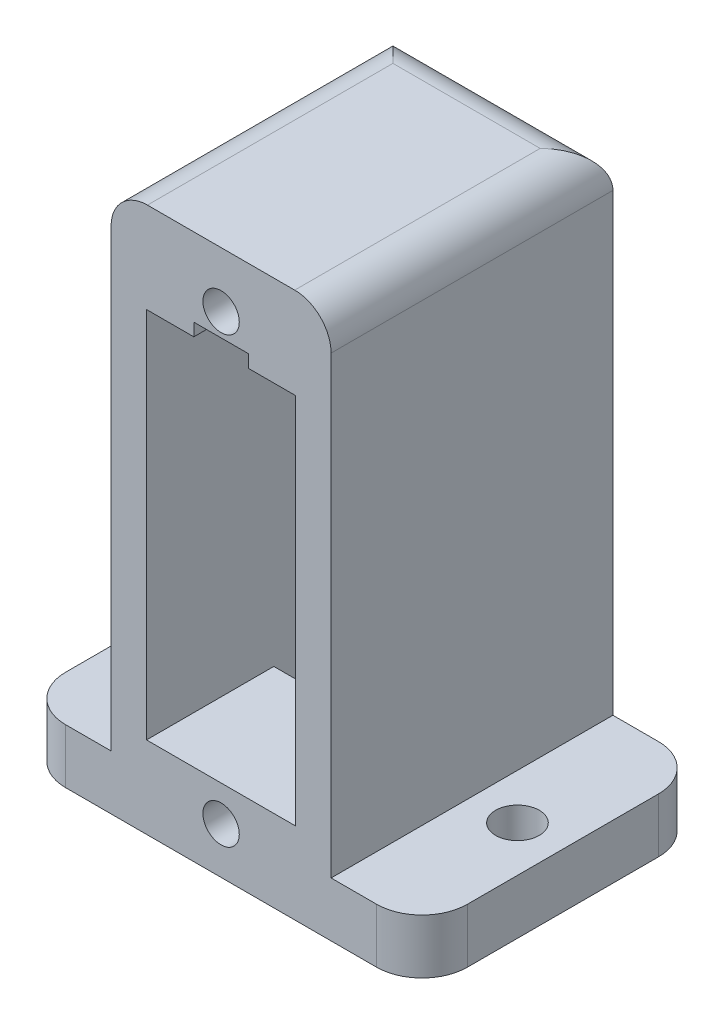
ISO-10303-21;
HEADER;
FILE_DESCRIPTION(('STEP AP214'),'2;1');
FILE_NAME('part.step','',(''),(''),'','','');
FILE_SCHEMA(('AUTOMOTIVE_DESIGN { 1 0 10303 214 1 1 1 1 }'));
ENDSEC;
DATA;
#1=APPLICATION_CONTEXT('core data for automotive mechanical design processes');
#2=APPLICATION_PROTOCOL_DEFINITION('international standard','automotive_design',2000,#1);
#3=PRODUCT_CONTEXT('',#1,'mechanical');
#4=PRODUCT('Part','Part','',(#3));
#5=PRODUCT_RELATED_PRODUCT_CATEGORY('part','',(#4));
#6=PRODUCT_DEFINITION_FORMATION('','',#4);
#7=PRODUCT_DEFINITION_CONTEXT('part definition',#1,'design');
#8=PRODUCT_DEFINITION('design','',#6,#7);
#9=PRODUCT_DEFINITION_SHAPE('','',#8);
#10=(LENGTH_UNIT() NAMED_UNIT(*) SI_UNIT(.MILLI.,.METRE.));
#11=(NAMED_UNIT(*) PLANE_ANGLE_UNIT() SI_UNIT($,.RADIAN.));
#12=(NAMED_UNIT(*) SI_UNIT($,.STERADIAN.) SOLID_ANGLE_UNIT());
#13=UNCERTAINTY_MEASURE_WITH_UNIT(LENGTH_MEASURE(1.E-05),#10,'distance_accuracy_value','');
#14=(GEOMETRIC_REPRESENTATION_CONTEXT(3) GLOBAL_UNCERTAINTY_ASSIGNED_CONTEXT((#13)) GLOBAL_UNIT_ASSIGNED_CONTEXT((#10,
#11,#12)) REPRESENTATION_CONTEXT('',''));
#15=CARTESIAN_POINT('',(0.,0.,0.));
#16=DIRECTION('',(0.,0.,1.));
#17=DIRECTION('',(1.,0.,0.));
#18=AXIS2_PLACEMENT_3D('',#15,#16,#17);
#19=CARTESIAN_POINT('',(12.1,0.,15.5));
#20=DIRECTION('',(-1.,0.,0.));
#21=DIRECTION('',(0.,0.,1.));
#22=AXIS2_PLACEMENT_3D('',#19,#20,#21);
#23=PLANE('',#22);
#24=DIRECTION('',(0.,0.,1.));
#25=VECTOR('',#24,1.);
#26=CARTESIAN_POINT('',(12.1,3.,15.5));
#27=LINE('',#26,#25);
#28=CARTESIAN_POINT('',(12.1,3.,0.));
#29=VERTEX_POINT('',#28);
#30=CARTESIAN_POINT('',(12.1,3.,15.5));
#31=VERTEX_POINT('',#30);
#32=EDGE_CURVE('E55',#29,#31,#27,.T.);
#33=ORIENTED_EDGE('',*,*,#32,.F.);
#34=DIRECTION('',(0.,1.,0.));
#35=VECTOR('',#34,1.);
#36=CARTESIAN_POINT('',(12.1,0.,0.));
#37=LINE('',#36,#35);
#38=CARTESIAN_POINT('',(12.1,28.,0.));
#39=VERTEX_POINT('',#38);
#40=EDGE_CURVE('E407',#29,#39,#37,.T.);
#41=ORIENTED_EDGE('',*,*,#40,.T.);
#42=DIRECTION('',(0.,0.,-1.));
#43=VECTOR('',#42,1.);
#44=CARTESIAN_POINT('',(12.1,28.,15.5));
#45=LINE('',#44,#43);
#46=CARTESIAN_POINT('',(12.1,28.,15.5));
#47=VERTEX_POINT('',#46);
#48=EDGE_CURVE('E11',#39,#47,#45,.F.);
#49=ORIENTED_EDGE('',*,*,#48,.T.);
#50=DIRECTION('',(0.,1.,0.));
#51=VECTOR('',#50,1.);
#52=CARTESIAN_POINT('',(12.1,0.,15.5));
#53=LINE('',#52,#51);
#54=EDGE_CURVE('E51',#31,#47,#53,.T.);
#55=ORIENTED_EDGE('',*,*,#54,.F.);
#56=EDGE_LOOP('',(#33,#41,#49,#55));
#57=FACE_BOUND('',#56,.T.);
#58=ADVANCED_FACE('F35',(#57),#23,.F.);
#59=CARTESIAN_POINT('',(0.,0.,15.5));
#60=DIRECTION('',(1.,0.,0.));
#61=DIRECTION('',(0.,0.,-1.));
#62=AXIS2_PLACEMENT_3D('',#59,#60,#61);
#63=PLANE('',#62);
#64=DIRECTION('',(0.,-1.,0.));
#65=VECTOR('',#64,1.);
#66=CARTESIAN_POINT('',(0.,0.,0.));
#67=LINE('',#66,#65);
#68=CARTESIAN_POINT('',(0.,28.,0.));
#69=VERTEX_POINT('',#68);
#70=CARTESIAN_POINT('',(0.,3.,0.));
#71=VERTEX_POINT('',#70);
#72=EDGE_CURVE('E389',#69,#71,#67,.T.);
#73=ORIENTED_EDGE('',*,*,#72,.T.);
#74=DIRECTION('',(0.,0.,1.));
#75=VECTOR('',#74,1.);
#76=CARTESIAN_POINT('',(0.,3.,15.5));
#77=LINE('',#76,#75);
#78=CARTESIAN_POINT('',(0.,3.,15.5));
#79=VERTEX_POINT('',#78);
#80=EDGE_CURVE('E251',#71,#79,#77,.T.);
#81=ORIENTED_EDGE('',*,*,#80,.T.);
#82=DIRECTION('',(0.,-1.,0.));
#83=VECTOR('',#82,1.);
#84=CARTESIAN_POINT('',(0.,0.,15.5));
#85=LINE('',#84,#83);
#86=CARTESIAN_POINT('',(0.,28.,15.5));
#87=VERTEX_POINT('',#86);
#88=EDGE_CURVE('E403',#87,#79,#85,.T.);
#89=ORIENTED_EDGE('',*,*,#88,.F.);
#90=DIRECTION('',(0.,0.,-1.));
#91=VECTOR('',#90,1.);
#92=CARTESIAN_POINT('',(0.,28.,15.5));
#93=LINE('',#92,#91);
#94=EDGE_CURVE('E431',#87,#69,#93,.T.);
#95=ORIENTED_EDGE('',*,*,#94,.T.);
#96=EDGE_LOOP('',(#73,#81,#89,#95));
#97=FACE_BOUND('',#96,.T.);
#98=ADVANCED_FACE('F452',(#97),#63,.F.);
#99=CARTESIAN_POINT('',(0.,0.,15.5));
#100=DIRECTION('',(0.,1.,0.));
#101=DIRECTION('',(0.,0.,1.));
#102=AXIS2_PLACEMENT_3D('',#99,#100,#101);
#103=PLANE('',#102);
#104=CARTESIAN_POINT('',(14.6,0.,13.));
#105=DIRECTION('',(0.,-1.,0.));
#106=DIRECTION('',(0.,0.,-1.));
#107=AXIS2_PLACEMENT_3D('',#104,#105,#106);
#108=CIRCLE('',#107,2.5);
#109=CARTESIAN_POINT('',(17.1,0.,13.));
#110=VERTEX_POINT('',#109);
#111=CARTESIAN_POINT('',(14.6,0.,15.5));
#112=VERTEX_POINT('',#111);
#113=EDGE_CURVE('E268',#110,#112,#108,.T.);
#114=ORIENTED_EDGE('',*,*,#113,.T.);
#115=DIRECTION('',(1.,0.,0.));
#116=VECTOR('',#115,1.);
#117=CARTESIAN_POINT('',(0.,0.,15.5));
#118=LINE('',#117,#116);
#119=CARTESIAN_POINT('',(-2.49999999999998,0.,15.5));
#120=VERTEX_POINT('',#119);
#121=EDGE_CURVE('E406',#120,#112,#118,.T.);
#122=ORIENTED_EDGE('',*,*,#121,.F.);
#123=CARTESIAN_POINT('',(-2.5,0.,13.));
#124=DIRECTION('',(0.,-1.,0.));
#125=DIRECTION('',(0.,0.,1.));
#126=AXIS2_PLACEMENT_3D('',#123,#124,#125);
#127=CIRCLE('',#126,2.5);
#128=CARTESIAN_POINT('',(-5.,0.,13.));
#129=VERTEX_POINT('',#128);
#130=EDGE_CURVE('E246',#120,#129,#127,.T.);
#131=ORIENTED_EDGE('',*,*,#130,.T.);
#132=DIRECTION('',(0.,0.,-1.));
#133=VECTOR('',#132,1.);
#134=CARTESIAN_POINT('',(-5.,0.,2.5));
#135=LINE('',#134,#133);
#136=CARTESIAN_POINT('',(-5.,0.,2.5));
#137=VERTEX_POINT('',#136);
#138=EDGE_CURVE('E212',#129,#137,#135,.T.);
#139=ORIENTED_EDGE('',*,*,#138,.T.);
#140=CARTESIAN_POINT('',(-2.5,0.,2.5));
#141=DIRECTION('',(0.,-1.,0.));
#142=DIRECTION('',(0.,0.,1.));
#143=AXIS2_PLACEMENT_3D('',#140,#141,#142);
#144=CIRCLE('',#143,2.5);
#145=CARTESIAN_POINT('',(-2.5,0.,0.));
#146=VERTEX_POINT('',#145);
#147=EDGE_CURVE('E233',#137,#146,#144,.T.);
#148=ORIENTED_EDGE('',*,*,#147,.T.);
#149=DIRECTION('',(1.,0.,0.));
#150=VECTOR('',#149,1.);
#151=CARTESIAN_POINT('',(0.,0.,0.));
#152=LINE('',#151,#150);
#153=CARTESIAN_POINT('',(1.95,0.,0.));
#154=VERTEX_POINT('',#153);
#155=EDGE_CURVE('E417',#146,#154,#152,.T.);
#156=ORIENTED_EDGE('',*,*,#155,.T.);
#157=DIRECTION('',(0.,0.,-1.));
#158=VECTOR('',#157,1.);
#159=CARTESIAN_POINT('',(1.95,0.,8.5));
#160=LINE('',#159,#158);
#161=CARTESIAN_POINT('',(1.95,0.,8.5));
#162=VERTEX_POINT('',#161);
#163=EDGE_CURVE('E312',#162,#154,#160,.T.);
#164=ORIENTED_EDGE('',*,*,#163,.F.);
#165=DIRECTION('',(-1.,0.,0.));
#166=VECTOR('',#165,1.);
#167=CARTESIAN_POINT('',(1.95,0.,8.5));
#168=LINE('',#167,#166);
#169=CARTESIAN_POINT('',(10.15,0.,8.5));
#170=VERTEX_POINT('',#169);
#171=EDGE_CURVE('E303',#170,#162,#168,.T.);
#172=ORIENTED_EDGE('',*,*,#171,.F.);
#173=DIRECTION('',(0.,0.,1.));
#174=VECTOR('',#173,1.);
#175=CARTESIAN_POINT('',(10.15,0.,8.5));
#176=LINE('',#175,#174);
#177=CARTESIAN_POINT('',(10.15,0.,0.));
#178=VERTEX_POINT('',#177);
#179=EDGE_CURVE('E315',#178,#170,#176,.T.);
#180=ORIENTED_EDGE('',*,*,#179,.F.);
#181=CARTESIAN_POINT('',(14.6,0.,0.));
#182=VERTEX_POINT('',#181);
#183=EDGE_CURVE('E416',#178,#182,#152,.T.);
#184=ORIENTED_EDGE('',*,*,#183,.T.);
#185=CARTESIAN_POINT('',(14.6,0.,2.5));
#186=DIRECTION('',(0.,-1.,0.));
#187=DIRECTION('',(0.,0.,-1.));
#188=AXIS2_PLACEMENT_3D('',#185,#186,#187);
#189=CIRCLE('',#188,2.5);
#190=CARTESIAN_POINT('',(17.1,0.,2.5));
#191=VERTEX_POINT('',#190);
#192=EDGE_CURVE('E262',#182,#191,#189,.T.);
#193=ORIENTED_EDGE('',*,*,#192,.T.);
#194=DIRECTION('',(0.,0.,1.));
#195=VECTOR('',#194,1.);
#196=CARTESIAN_POINT('',(17.1,0.,2.5));
#197=LINE('',#196,#195);
#198=EDGE_CURVE('E283',#191,#110,#197,.T.);
#199=ORIENTED_EDGE('',*,*,#198,.T.);
#200=EDGE_LOOP('',(#114,#122,#131,#139,#148,#156,#164,#172,#180,#184,#193,#199));
#201=FACE_BOUND('',#200,.T.);
#202=CARTESIAN_POINT('',(14.6,0.,7.75));
#203=DIRECTION('',(0.,-1.,0.));
#204=DIRECTION('',(0.,0.,-1.));
#205=AXIS2_PLACEMENT_3D('',#202,#203,#204);
#206=CIRCLE('',#205,1.20000000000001);
#207=CARTESIAN_POINT('',(14.6,0.,6.55));
#208=VERTEX_POINT('',#207);
#209=EDGE_CURVE('E258',#208,#208,#206,.T.);
#210=ORIENTED_EDGE('',*,*,#209,.F.);
#211=EDGE_LOOP('',(#210));
#212=FACE_BOUND('',#211,.T.);
#213=CARTESIAN_POINT('',(-2.5,0.,7.75));
#214=DIRECTION('',(0.,-1.,0.));
#215=DIRECTION('',(0.,0.,1.));
#216=AXIS2_PLACEMENT_3D('',#213,#214,#215);
#217=CIRCLE('',#216,1.20000000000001);
#218=CARTESIAN_POINT('',(-2.5,0.,8.95000000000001));
#219=VERTEX_POINT('',#218);
#220=EDGE_CURVE('E238',#219,#219,#217,.T.);
#221=ORIENTED_EDGE('',*,*,#220,.F.);
#222=EDGE_LOOP('',(#221));
#223=FACE_BOUND('',#222,.T.);
#224=ADVANCED_FACE('F477',(#201,#212,#223),#103,.F.);
#225=CARTESIAN_POINT('',(0.,30.,15.5));
#226=DIRECTION('',(0.,-1.,0.));
#227=DIRECTION('',(0.,0.,-1.));
#228=AXIS2_PLACEMENT_3D('',#225,#226,#227);
#229=PLANE('',#228);
#230=DIRECTION('',(-1.,0.,0.));
#231=VECTOR('',#230,1.);
#232=CARTESIAN_POINT('',(0.,30.,2.));
#233=LINE('',#232,#231);
#234=CARTESIAN_POINT('',(10.1,30.,2.));
#235=VERTEX_POINT('',#234);
#236=CARTESIAN_POINT('',(2.,30.,2.));
#237=VERTEX_POINT('',#236);
#238=EDGE_CURVE('E423',#235,#237,#233,.T.);
#239=ORIENTED_EDGE('',*,*,#238,.T.);
#240=DIRECTION('',(0.,0.,-1.));
#241=VECTOR('',#240,1.);
#242=CARTESIAN_POINT('',(2.,30.,15.5));
#243=LINE('',#242,#241);
#244=CARTESIAN_POINT('',(2.,30.,15.5));
#245=VERTEX_POINT('',#244);
#246=EDGE_CURVE('E426',#237,#245,#243,.F.);
#247=ORIENTED_EDGE('',*,*,#246,.T.);
#248=DIRECTION('',(-1.,0.,0.));
#249=VECTOR('',#248,1.);
#250=CARTESIAN_POINT('',(0.,30.,15.5));
#251=LINE('',#250,#249);
#252=CARTESIAN_POINT('',(10.1,30.,15.5));
#253=VERTEX_POINT('',#252);
#254=EDGE_CURVE('E410',#253,#245,#251,.T.);
#255=ORIENTED_EDGE('',*,*,#254,.F.);
#256=DIRECTION('',(0.,0.,-1.));
#257=VECTOR('',#256,1.);
#258=CARTESIAN_POINT('',(10.1,30.,15.5));
#259=LINE('',#258,#257);
#260=EDGE_CURVE('E413',#253,#235,#259,.T.);
#261=ORIENTED_EDGE('',*,*,#260,.T.);
#262=EDGE_LOOP('',(#239,#247,#255,#261));
#263=FACE_BOUND('',#262,.T.);
#264=ADVANCED_FACE('F460',(#263),#229,.F.);
#265=CARTESIAN_POINT('',(0.,0.,15.5));
#266=DIRECTION('',(0.,0.,-1.));
#267=DIRECTION('',(-1.,0.,0.));
#268=AXIS2_PLACEMENT_3D('',#265,#266,#267);
#269=PLANE('',#268);
#270=ORIENTED_EDGE('',*,*,#121,.T.);
#271=DIRECTION('',(0.,-1.,0.));
#272=VECTOR('',#271,1.);
#273=CARTESIAN_POINT('',(14.6,3.,15.5));
#274=LINE('',#273,#272);
#275=CARTESIAN_POINT('',(14.6,3.,15.5));
#276=VERTEX_POINT('',#275);
#277=EDGE_CURVE('E288',#276,#112,#274,.T.);
#278=ORIENTED_EDGE('',*,*,#277,.F.);
#279=DIRECTION('',(-1.,0.,0.));
#280=VECTOR('',#279,1.);
#281=CARTESIAN_POINT('',(14.6,3.,15.5));
#282=LINE('',#281,#280);
#283=EDGE_CURVE('E277',#276,#31,#282,.T.);
#284=ORIENTED_EDGE('',*,*,#283,.T.);
#285=ORIENTED_EDGE('',*,*,#54,.T.);
#286=CARTESIAN_POINT('',(10.1,28.,15.5));
#287=DIRECTION('',(0.,0.,-1.));
#288=DIRECTION('',(-1.,0.,0.));
#289=AXIS2_PLACEMENT_3D('',#286,#287,#288);
#290=CIRCLE('',#289,2.);
#291=EDGE_CURVE('E433',#47,#253,#290,.F.);
#292=ORIENTED_EDGE('',*,*,#291,.T.);
#293=ORIENTED_EDGE('',*,*,#254,.T.);
#294=CARTESIAN_POINT('',(2.,28.,15.5));
#295=DIRECTION('',(0.,0.,-1.));
#296=DIRECTION('',(-1.,0.,0.));
#297=AXIS2_PLACEMENT_3D('',#294,#295,#296);
#298=CIRCLE('',#297,2.);
#299=EDGE_CURVE('E44',#245,#87,#298,.F.);
#300=ORIENTED_EDGE('',*,*,#299,.T.);
#301=ORIENTED_EDGE('',*,*,#88,.T.);
#302=DIRECTION('',(-1.,0.,0.));
#303=VECTOR('',#302,1.);
#304=CARTESIAN_POINT('',(-2.49999999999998,3.,15.5));
#305=LINE('',#304,#303);
#306=CARTESIAN_POINT('',(-2.49999999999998,3.,15.5));
#307=VERTEX_POINT('',#306);
#308=EDGE_CURVE('E218',#79,#307,#305,.T.);
#309=ORIENTED_EDGE('',*,*,#308,.T.);
#310=DIRECTION('',(0.,-1.,0.));
#311=VECTOR('',#310,1.);
#312=CARTESIAN_POINT('',(-2.49999999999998,3.,15.5));
#313=LINE('',#312,#311);
#314=EDGE_CURVE('E232',#307,#120,#313,.T.);
#315=ORIENTED_EDGE('',*,*,#314,.T.);
#316=EDGE_LOOP('',(#270,#278,#284,#285,#292,#293,#300,#301,#309,#315));
#317=FACE_BOUND('',#316,.T.);
#318=CARTESIAN_POINT('',(6.05,2.54999999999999,15.5));
#319=DIRECTION('',(0.,0.,1.));
#320=DIRECTION('',(-1.,0.,0.));
#321=AXIS2_PLACEMENT_3D('',#318,#319,#320);
#322=CIRCLE('',#321,1.);
#323=CARTESIAN_POINT('',(5.05,2.54999999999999,15.5));
#324=VERTEX_POINT('',#323);
#325=EDGE_CURVE('E329',#324,#324,#322,.T.);
#326=ORIENTED_EDGE('',*,*,#325,.F.);
#327=EDGE_LOOP('',(#326));
#328=FACE_BOUND('',#327,.T.);
#329=CARTESIAN_POINT('',(6.05,26.95,15.5));
#330=DIRECTION('',(0.,0.,1.));
#331=DIRECTION('',(1.,0.,0.));
#332=AXIS2_PLACEMENT_3D('',#329,#330,#331);
#333=CIRCLE('',#332,1.);
#334=CARTESIAN_POINT('',(7.05,26.95,15.5));
#335=VERTEX_POINT('',#334);
#336=EDGE_CURVE('E332',#335,#335,#333,.T.);
#337=ORIENTED_EDGE('',*,*,#336,.F.);
#338=EDGE_LOOP('',(#337));
#339=FACE_BOUND('',#338,.T.);
#340=DIRECTION('',(1.,0.,0.));
#341=VECTOR('',#340,1.);
#342=CARTESIAN_POINT('',(1.95,4.49999999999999,15.5));
#343=LINE('',#342,#341);
#344=CARTESIAN_POINT('',(1.95,4.49999999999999,15.5));
#345=VERTEX_POINT('',#344);
#346=CARTESIAN_POINT('',(10.15,4.49999999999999,15.5));
#347=VERTEX_POINT('',#346);
#348=EDGE_CURVE('E367',#345,#347,#343,.T.);
#349=ORIENTED_EDGE('',*,*,#348,.F.);
#350=DIRECTION('',(0.,-1.,0.));
#351=VECTOR('',#350,1.);
#352=CARTESIAN_POINT('',(1.95,25.,15.5));
#353=LINE('',#352,#351);
#354=CARTESIAN_POINT('',(1.95,25.,15.5));
#355=VERTEX_POINT('',#354);
#356=EDGE_CURVE('E336',#355,#345,#353,.T.);
#357=ORIENTED_EDGE('',*,*,#356,.F.);
#358=DIRECTION('',(-1.,0.,0.));
#359=VECTOR('',#358,1.);
#360=CARTESIAN_POINT('',(1.95,25.,15.5));
#361=LINE('',#360,#359);
#362=CARTESIAN_POINT('',(4.55,25.,15.5));
#363=VERTEX_POINT('',#362);
#364=EDGE_CURVE('E343',#363,#355,#361,.T.);
#365=ORIENTED_EDGE('',*,*,#364,.F.);
#366=DIRECTION('',(0.,-1.,0.));
#367=VECTOR('',#366,1.);
#368=CARTESIAN_POINT('',(4.55,25.7,15.5));
#369=LINE('',#368,#367);
#370=CARTESIAN_POINT('',(4.55,25.7,15.5));
#371=VERTEX_POINT('',#370);
#372=EDGE_CURVE('E382',#371,#363,#369,.T.);
#373=ORIENTED_EDGE('',*,*,#372,.F.);
#374=DIRECTION('',(-1.,0.,0.));
#375=VECTOR('',#374,1.);
#376=CARTESIAN_POINT('',(7.55,25.7,15.5));
#377=LINE('',#376,#375);
#378=CARTESIAN_POINT('',(7.55,25.7,15.5));
#379=VERTEX_POINT('',#378);
#380=EDGE_CURVE('E379',#379,#371,#377,.T.);
#381=ORIENTED_EDGE('',*,*,#380,.F.);
#382=DIRECTION('',(0.,1.,0.));
#383=VECTOR('',#382,1.);
#384=CARTESIAN_POINT('',(7.55,25.7,15.5));
#385=LINE('',#384,#383);
#386=CARTESIAN_POINT('',(7.55,25.,15.5));
#387=VERTEX_POINT('',#386);
#388=EDGE_CURVE('E376',#387,#379,#385,.T.);
#389=ORIENTED_EDGE('',*,*,#388,.F.);
#390=DIRECTION('',(-1.,0.,0.));
#391=VECTOR('',#390,1.);
#392=CARTESIAN_POINT('',(7.55,25.,15.5));
#393=LINE('',#392,#391);
#394=CARTESIAN_POINT('',(10.15,25.,15.5));
#395=VERTEX_POINT('',#394);
#396=EDGE_CURVE('E373',#395,#387,#393,.T.);
#397=ORIENTED_EDGE('',*,*,#396,.F.);
#398=DIRECTION('',(0.,1.,0.));
#399=VECTOR('',#398,1.);
#400=CARTESIAN_POINT('',(10.15,25.,15.5));
#401=LINE('',#400,#399);
#402=EDGE_CURVE('E370',#347,#395,#401,.T.);
#403=ORIENTED_EDGE('',*,*,#402,.F.);
#404=EDGE_LOOP('',(#349,#357,#365,#373,#381,#389,#397,#403));
#405=FACE_BOUND('',#404,.T.);
#406=ADVANCED_FACE('F462',(#317,#328,#339,#405),#269,.F.);
#407=CARTESIAN_POINT('',(0.,0.,0.));
#408=DIRECTION('',(0.,0.,-1.));
#409=DIRECTION('',(-1.,0.,0.));
#410=AXIS2_PLACEMENT_3D('',#407,#408,#409);
#411=PLANE('',#410);
#412=DIRECTION('',(0.,-1.,0.));
#413=VECTOR('',#412,1.);
#414=CARTESIAN_POINT('',(1.95,4.5,0.));
#415=LINE('',#414,#413);
#416=CARTESIAN_POINT('',(1.95,4.5,0.));
#417=VERTEX_POINT('',#416);
#418=EDGE_CURVE('E311',#417,#154,#415,.T.);
#419=ORIENTED_EDGE('',*,*,#418,.T.);
#420=ORIENTED_EDGE('',*,*,#155,.F.);
#421=DIRECTION('',(0.,-1.,0.));
#422=VECTOR('',#421,1.);
#423=CARTESIAN_POINT('',(-2.5,3.,0.));
#424=LINE('',#423,#422);
#425=CARTESIAN_POINT('',(-2.5,3.,0.));
#426=VERTEX_POINT('',#425);
#427=EDGE_CURVE('E252',#426,#146,#424,.T.);
#428=ORIENTED_EDGE('',*,*,#427,.F.);
#429=DIRECTION('',(1.,0.,0.));
#430=VECTOR('',#429,1.);
#431=CARTESIAN_POINT('',(-2.5,3.,0.));
#432=LINE('',#431,#430);
#433=EDGE_CURVE('E242',#426,#71,#432,.T.);
#434=ORIENTED_EDGE('',*,*,#433,.T.);
#435=ORIENTED_EDGE('',*,*,#72,.F.);
#436=DIRECTION('',(-1.,0.,0.));
#437=VECTOR('',#436,1.);
#438=CARTESIAN_POINT('',(12.1,28.,0.));
#439=LINE('',#438,#437);
#440=EDGE_CURVE('E428',#69,#39,#439,.F.);
#441=ORIENTED_EDGE('',*,*,#440,.T.);
#442=ORIENTED_EDGE('',*,*,#40,.F.);
#443=DIRECTION('',(1.,0.,0.));
#444=VECTOR('',#443,1.);
#445=CARTESIAN_POINT('',(14.6,3.,0.));
#446=LINE('',#445,#444);
#447=CARTESIAN_POINT('',(14.6,3.,0.));
#448=VERTEX_POINT('',#447);
#449=EDGE_CURVE('E265',#29,#448,#446,.T.);
#450=ORIENTED_EDGE('',*,*,#449,.T.);
#451=DIRECTION('',(0.,-1.,0.));
#452=VECTOR('',#451,1.);
#453=CARTESIAN_POINT('',(14.6,3.,0.));
#454=LINE('',#453,#452);
#455=EDGE_CURVE('E280',#448,#182,#454,.T.);
#456=ORIENTED_EDGE('',*,*,#455,.T.);
#457=ORIENTED_EDGE('',*,*,#183,.F.);
#458=DIRECTION('',(0.,-1.,0.));
#459=VECTOR('',#458,1.);
#460=CARTESIAN_POINT('',(10.15,4.5,0.));
#461=LINE('',#460,#459);
#462=CARTESIAN_POINT('',(10.15,4.5,0.));
#463=VERTEX_POINT('',#462);
#464=EDGE_CURVE('E325',#463,#178,#461,.T.);
#465=ORIENTED_EDGE('',*,*,#464,.F.);
#466=DIRECTION('',(1.,0.,0.));
#467=VECTOR('',#466,1.);
#468=CARTESIAN_POINT('',(1.95,4.5,0.));
#469=LINE('',#468,#467);
#470=EDGE_CURVE('E302',#417,#463,#469,.T.);
#471=ORIENTED_EDGE('',*,*,#470,.F.);
#472=EDGE_LOOP('',(#419,#420,#428,#434,#435,#441,#442,#450,#456,#457,#465,#471));
#473=FACE_BOUND('',#472,.T.);
#474=ADVANCED_FACE('F450',(#473),#411,.T.);
#475=CARTESIAN_POINT('',(1.95,25.,2.));
#476=DIRECTION('',(-1.,0.,0.));
#477=DIRECTION('',(0.,-1.,0.));
#478=AXIS2_PLACEMENT_3D('',#475,#476,#477);
#479=PLANE('',#478);
#480=ORIENTED_EDGE('',*,*,#356,.T.);
#481=DIRECTION('',(0.,0.,1.));
#482=VECTOR('',#481,1.);
#483=CARTESIAN_POINT('',(1.95,4.49999999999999,2.));
#484=LINE('',#483,#482);
#485=CARTESIAN_POINT('',(1.95,4.5,8.5));
#486=VERTEX_POINT('',#485);
#487=EDGE_CURVE('E364',#486,#345,#484,.T.);
#488=ORIENTED_EDGE('',*,*,#487,.F.);
#489=DIRECTION('',(0.,-1.,0.));
#490=VECTOR('',#489,1.);
#491=CARTESIAN_POINT('',(1.95,4.5,8.5));
#492=LINE('',#491,#490);
#493=EDGE_CURVE('E320',#486,#162,#492,.T.);
#494=ORIENTED_EDGE('',*,*,#493,.T.);
#495=ORIENTED_EDGE('',*,*,#163,.T.);
#496=ORIENTED_EDGE('',*,*,#418,.F.);
#497=DIRECTION('',(0.,0.,-1.));
#498=VECTOR('',#497,1.);
#499=CARTESIAN_POINT('',(1.95,4.5,8.5));
#500=LINE('',#499,#498);
#501=CARTESIAN_POINT('',(1.95,4.5,2.));
#502=VERTEX_POINT('',#501);
#503=EDGE_CURVE('E299',#502,#417,#500,.T.);
#504=ORIENTED_EDGE('',*,*,#503,.F.);
#505=DIRECTION('',(0.,-1.,0.));
#506=VECTOR('',#505,1.);
#507=CARTESIAN_POINT('',(1.95,25.,2.));
#508=LINE('',#507,#506);
#509=CARTESIAN_POINT('',(1.95,25.,2.));
#510=VERTEX_POINT('',#509);
#511=EDGE_CURVE('E339',#510,#502,#508,.T.);
#512=ORIENTED_EDGE('',*,*,#511,.F.);
#513=DIRECTION('',(0.,0.,1.));
#514=VECTOR('',#513,1.);
#515=CARTESIAN_POINT('',(1.95,25.,2.));
#516=LINE('',#515,#514);
#517=EDGE_CURVE('E387',#510,#355,#516,.T.);
#518=ORIENTED_EDGE('',*,*,#517,.T.);
#519=EDGE_LOOP('',(#480,#488,#494,#495,#496,#504,#512,#518));
#520=FACE_BOUND('',#519,.T.);
#521=ADVANCED_FACE('F491',(#520),#479,.F.);
#522=CARTESIAN_POINT('',(1.95,25.,2.));
#523=DIRECTION('',(0.,1.,0.));
#524=DIRECTION('',(0.,0.,1.));
#525=AXIS2_PLACEMENT_3D('',#522,#523,#524);
#526=PLANE('',#525);
#527=ORIENTED_EDGE('',*,*,#364,.T.);
#528=ORIENTED_EDGE('',*,*,#517,.F.);
#529=DIRECTION('',(-1.,0.,0.));
#530=VECTOR('',#529,1.);
#531=CARTESIAN_POINT('',(1.95,25.,2.));
#532=LINE('',#531,#530);
#533=CARTESIAN_POINT('',(4.55,25.,2.));
#534=VERTEX_POINT('',#533);
#535=EDGE_CURVE('E361',#534,#510,#532,.T.);
#536=ORIENTED_EDGE('',*,*,#535,.F.);
#537=DIRECTION('',(0.,0.,1.));
#538=VECTOR('',#537,1.);
#539=CARTESIAN_POINT('',(4.55,25.,2.));
#540=LINE('',#539,#538);
#541=EDGE_CURVE('E390',#534,#363,#540,.T.);
#542=ORIENTED_EDGE('',*,*,#541,.T.);
#543=EDGE_LOOP('',(#527,#528,#536,#542));
#544=FACE_BOUND('',#543,.T.);
#545=ADVANCED_FACE('F497',(#544),#526,.F.);
#546=CARTESIAN_POINT('',(4.55,25.7,2.));
#547=DIRECTION('',(-1.,0.,0.));
#548=DIRECTION('',(0.,0.,1.));
#549=AXIS2_PLACEMENT_3D('',#546,#547,#548);
#550=PLANE('',#549);
#551=ORIENTED_EDGE('',*,*,#372,.T.);
#552=ORIENTED_EDGE('',*,*,#541,.F.);
#553=DIRECTION('',(0.,-1.,0.));
#554=VECTOR('',#553,1.);
#555=CARTESIAN_POINT('',(4.55,25.7,2.));
#556=LINE('',#555,#554);
#557=CARTESIAN_POINT('',(4.55,25.7,2.));
#558=VERTEX_POINT('',#557);
#559=EDGE_CURVE('E358',#558,#534,#556,.T.);
#560=ORIENTED_EDGE('',*,*,#559,.F.);
#561=DIRECTION('',(0.,0.,1.));
#562=VECTOR('',#561,1.);
#563=CARTESIAN_POINT('',(4.55,25.7,2.));
#564=LINE('',#563,#562);
#565=EDGE_CURVE('E392',#558,#371,#564,.T.);
#566=ORIENTED_EDGE('',*,*,#565,.T.);
#567=EDGE_LOOP('',(#551,#552,#560,#566));
#568=FACE_BOUND('',#567,.T.);
#569=ADVANCED_FACE('F571',(#568),#550,.F.);
#570=CARTESIAN_POINT('',(7.55,25.7,2.));
#571=DIRECTION('',(0.,1.,0.));
#572=DIRECTION('',(0.,0.,1.));
#573=AXIS2_PLACEMENT_3D('',#570,#571,#572);
#574=PLANE('',#573);
#575=ORIENTED_EDGE('',*,*,#380,.T.);
#576=ORIENTED_EDGE('',*,*,#565,.F.);
#577=DIRECTION('',(-1.,0.,0.));
#578=VECTOR('',#577,1.);
#579=CARTESIAN_POINT('',(7.55,25.7,2.));
#580=LINE('',#579,#578);
#581=CARTESIAN_POINT('',(7.55,25.7,2.));
#582=VERTEX_POINT('',#581);
#583=EDGE_CURVE('E355',#582,#558,#580,.T.);
#584=ORIENTED_EDGE('',*,*,#583,.F.);
#585=DIRECTION('',(0.,0.,1.));
#586=VECTOR('',#585,1.);
#587=CARTESIAN_POINT('',(7.55,25.7,2.));
#588=LINE('',#587,#586);
#589=EDGE_CURVE('E394',#582,#379,#588,.T.);
#590=ORIENTED_EDGE('',*,*,#589,.T.);
#591=EDGE_LOOP('',(#575,#576,#584,#590));
#592=FACE_BOUND('',#591,.T.);
#593=ADVANCED_FACE('F574',(#592),#574,.F.);
#594=CARTESIAN_POINT('',(7.55,25.7,2.));
#595=DIRECTION('',(1.,0.,0.));
#596=DIRECTION('',(0.,0.,-1.));
#597=AXIS2_PLACEMENT_3D('',#594,#595,#596);
#598=PLANE('',#597);
#599=ORIENTED_EDGE('',*,*,#388,.T.);
#600=ORIENTED_EDGE('',*,*,#589,.F.);
#601=DIRECTION('',(0.,1.,0.));
#602=VECTOR('',#601,1.);
#603=CARTESIAN_POINT('',(7.55,25.7,2.));
#604=LINE('',#603,#602);
#605=CARTESIAN_POINT('',(7.55,25.,2.));
#606=VERTEX_POINT('',#605);
#607=EDGE_CURVE('E352',#606,#582,#604,.T.);
#608=ORIENTED_EDGE('',*,*,#607,.F.);
#609=DIRECTION('',(0.,0.,1.));
#610=VECTOR('',#609,1.);
#611=CARTESIAN_POINT('',(7.55,25.,2.));
#612=LINE('',#611,#610);
#613=EDGE_CURVE('E396',#606,#387,#612,.T.);
#614=ORIENTED_EDGE('',*,*,#613,.T.);
#615=EDGE_LOOP('',(#599,#600,#608,#614));
#616=FACE_BOUND('',#615,.T.);
#617=ADVANCED_FACE('F578',(#616),#598,.F.);
#618=CARTESIAN_POINT('',(7.55,25.,2.));
#619=DIRECTION('',(0.,1.,0.));
#620=DIRECTION('',(0.,0.,1.));
#621=AXIS2_PLACEMENT_3D('',#618,#619,#620);
#622=PLANE('',#621);
#623=ORIENTED_EDGE('',*,*,#396,.T.);
#624=ORIENTED_EDGE('',*,*,#613,.F.);
#625=DIRECTION('',(-1.,0.,0.));
#626=VECTOR('',#625,1.);
#627=CARTESIAN_POINT('',(7.55,25.,2.));
#628=LINE('',#627,#626);
#629=CARTESIAN_POINT('',(10.15,25.,2.));
#630=VERTEX_POINT('',#629);
#631=EDGE_CURVE('E349',#630,#606,#628,.T.);
#632=ORIENTED_EDGE('',*,*,#631,.F.);
#633=DIRECTION('',(0.,0.,1.));
#634=VECTOR('',#633,1.);
#635=CARTESIAN_POINT('',(10.15,25.,2.));
#636=LINE('',#635,#634);
#637=EDGE_CURVE('E398',#630,#395,#636,.T.);
#638=ORIENTED_EDGE('',*,*,#637,.T.);
#639=EDGE_LOOP('',(#623,#624,#632,#638));
#640=FACE_BOUND('',#639,.T.);
#641=ADVANCED_FACE('F582',(#640),#622,.F.);
#642=CARTESIAN_POINT('',(10.15,25.,2.));
#643=DIRECTION('',(1.,0.,0.));
#644=DIRECTION('',(0.,1.,0.));
#645=AXIS2_PLACEMENT_3D('',#642,#643,#644);
#646=PLANE('',#645);
#647=ORIENTED_EDGE('',*,*,#402,.T.);
#648=ORIENTED_EDGE('',*,*,#637,.F.);
#649=DIRECTION('',(0.,1.,0.));
#650=VECTOR('',#649,1.);
#651=CARTESIAN_POINT('',(10.15,25.,2.));
#652=LINE('',#651,#650);
#653=CARTESIAN_POINT('',(10.15,4.49999999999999,2.));
#654=VERTEX_POINT('',#653);
#655=EDGE_CURVE('E346',#654,#630,#652,.T.);
#656=ORIENTED_EDGE('',*,*,#655,.F.);
#657=DIRECTION('',(0.,0.,1.));
#658=VECTOR('',#657,1.);
#659=CARTESIAN_POINT('',(10.15,4.5,8.5));
#660=LINE('',#659,#658);
#661=EDGE_CURVE('E306',#463,#654,#660,.T.);
#662=ORIENTED_EDGE('',*,*,#661,.F.);
#663=ORIENTED_EDGE('',*,*,#464,.T.);
#664=ORIENTED_EDGE('',*,*,#179,.T.);
#665=DIRECTION('',(0.,-1.,0.));
#666=VECTOR('',#665,1.);
#667=CARTESIAN_POINT('',(10.15,4.5,8.5));
#668=LINE('',#667,#666);
#669=CARTESIAN_POINT('',(10.15,4.5,8.5));
#670=VERTEX_POINT('',#669);
#671=EDGE_CURVE('E323',#670,#170,#668,.T.);
#672=ORIENTED_EDGE('',*,*,#671,.F.);
#673=DIRECTION('',(0.,0.,1.));
#674=VECTOR('',#673,1.);
#675=CARTESIAN_POINT('',(10.15,4.49999999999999,2.));
#676=LINE('',#675,#674);
#677=EDGE_CURVE('E400',#670,#347,#676,.T.);
#678=ORIENTED_EDGE('',*,*,#677,.T.);
#679=EDGE_LOOP('',(#647,#648,#656,#662,#663,#664,#672,#678));
#680=FACE_BOUND('',#679,.T.);
#681=ADVANCED_FACE('F484',(#680),#646,.F.);
#682=CARTESIAN_POINT('',(1.95,4.49999999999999,2.));
#683=DIRECTION('',(0.,-1.,0.));
#684=DIRECTION('',(0.,0.,-1.));
#685=AXIS2_PLACEMENT_3D('',#682,#683,#684);
#686=PLANE('',#685);
#687=ORIENTED_EDGE('',*,*,#677,.F.);
#688=DIRECTION('',(-1.,0.,0.));
#689=VECTOR('',#688,1.);
#690=CARTESIAN_POINT('',(1.95,4.5,8.5));
#691=LINE('',#690,#689);
#692=EDGE_CURVE('E308',#670,#486,#691,.T.);
#693=ORIENTED_EDGE('',*,*,#692,.T.);
#694=ORIENTED_EDGE('',*,*,#487,.T.);
#695=ORIENTED_EDGE('',*,*,#348,.T.);
#696=EDGE_LOOP('',(#687,#693,#694,#695));
#697=FACE_BOUND('',#696,.T.);
#698=ADVANCED_FACE('F507',(#697),#686,.F.);
#699=CARTESIAN_POINT('',(0.,0.,2.));
#700=DIRECTION('',(0.,0.,1.));
#701=DIRECTION('',(1.,0.,0.));
#702=AXIS2_PLACEMENT_3D('',#699,#700,#701);
#703=PLANE('',#702);
#704=ORIENTED_EDGE('',*,*,#511,.T.);
#705=DIRECTION('',(1.,0.,0.));
#706=VECTOR('',#705,1.);
#707=CARTESIAN_POINT('',(1.95,4.49999999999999,2.));
#708=LINE('',#707,#706);
#709=EDGE_CURVE('E342',#502,#654,#708,.T.);
#710=ORIENTED_EDGE('',*,*,#709,.T.);
#711=ORIENTED_EDGE('',*,*,#655,.T.);
#712=ORIENTED_EDGE('',*,*,#631,.T.);
#713=ORIENTED_EDGE('',*,*,#607,.T.);
#714=ORIENTED_EDGE('',*,*,#583,.T.);
#715=ORIENTED_EDGE('',*,*,#559,.T.);
#716=ORIENTED_EDGE('',*,*,#535,.T.);
#717=EDGE_LOOP('',(#704,#710,#711,#712,#713,#714,#715,#716));
#718=FACE_BOUND('',#717,.T.);
#719=ADVANCED_FACE('F493',(#718),#703,.T.);
#720=CARTESIAN_POINT('',(6.05,26.95,2.));
#721=DIRECTION('',(0.,0.,1.));
#722=DIRECTION('',(1.,0.,0.));
#723=AXIS2_PLACEMENT_3D('',#720,#721,#722);
#724=CYLINDRICAL_SURFACE('',#723,1.);
#725=CARTESIAN_POINT('',(6.05,26.95,2.));
#726=DIRECTION('',(0.,0.,1.));
#727=DIRECTION('',(1.,0.,0.));
#728=AXIS2_PLACEMENT_3D('',#725,#726,#727);
#729=CIRCLE('',#728,1.);
#730=CARTESIAN_POINT('',(7.05,26.95,2.));
#731=VERTEX_POINT('',#730);
#732=EDGE_CURVE('E333',#731,#731,#729,.T.);
#733=ORIENTED_EDGE('',*,*,#732,.F.);
#734=EDGE_LOOP('',(#733));
#735=FACE_BOUND('',#734,.T.);
#736=ORIENTED_EDGE('',*,*,#336,.T.);
#737=EDGE_LOOP('',(#736));
#738=FACE_BOUND('',#737,.T.);
#739=ADVANCED_FACE('F562',(#735,#738),#724,.F.);
#740=CARTESIAN_POINT('',(6.05,26.95,2.));
#741=DIRECTION('',(0.,0.,1.));
#742=DIRECTION('',(1.,0.,0.));
#743=AXIS2_PLACEMENT_3D('',#740,#741,#742);
#744=PLANE('',#743);
#745=ORIENTED_EDGE('',*,*,#732,.T.);
#746=EDGE_LOOP('',(#745));
#747=FACE_BOUND('',#746,.T.);
#748=ADVANCED_FACE('F558',(#747),#744,.T.);
#749=CARTESIAN_POINT('',(6.05,2.54999999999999,2.));
#750=DIRECTION('',(0.,0.,1.));
#751=DIRECTION('',(1.,0.,0.));
#752=AXIS2_PLACEMENT_3D('',#749,#750,#751);
#753=CYLINDRICAL_SURFACE('',#752,1.);
#754=CARTESIAN_POINT('',(6.05,2.54999999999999,8.5));
#755=DIRECTION('',(0.,0.,1.));
#756=DIRECTION('',(1.,0.,0.));
#757=AXIS2_PLACEMENT_3D('',#754,#755,#756);
#758=CIRCLE('',#757,1.);
#759=CARTESIAN_POINT('',(7.05,2.54999999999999,8.5));
#760=VERTEX_POINT('',#759);
#761=EDGE_CURVE('E322',#760,#760,#758,.F.);
#762=ORIENTED_EDGE('',*,*,#761,.T.);
#763=EDGE_LOOP('',(#762));
#764=FACE_BOUND('',#763,.T.);
#765=ORIENTED_EDGE('',*,*,#325,.T.);
#766=EDGE_LOOP('',(#765));
#767=FACE_BOUND('',#766,.T.);
#768=ADVANCED_FACE('F553',(#764,#767),#753,.F.);
#769=CARTESIAN_POINT('',(1.95,4.5,8.5));
#770=DIRECTION('',(0.,0.,1.));
#771=DIRECTION('',(1.,0.,0.));
#772=AXIS2_PLACEMENT_3D('',#769,#770,#771);
#773=PLANE('',#772);
#774=ORIENTED_EDGE('',*,*,#171,.T.);
#775=ORIENTED_EDGE('',*,*,#493,.F.);
#776=ORIENTED_EDGE('',*,*,#692,.F.);
#777=ORIENTED_EDGE('',*,*,#671,.T.);
#778=EDGE_LOOP('',(#774,#775,#776,#777));
#779=FACE_BOUND('',#778,.T.);
#780=ORIENTED_EDGE('',*,*,#761,.F.);
#781=EDGE_LOOP('',(#780));
#782=FACE_BOUND('',#781,.T.);
#783=ADVANCED_FACE('F510',(#779,#782),#773,.F.);
#784=CARTESIAN_POINT('',(0.,4.5,0.));
#785=DIRECTION('',(0.,-1.,0.));
#786=DIRECTION('',(0.,0.,-1.));
#787=AXIS2_PLACEMENT_3D('',#784,#785,#786);
#788=PLANE('',#787);
#789=ORIENTED_EDGE('',*,*,#503,.T.);
#790=ORIENTED_EDGE('',*,*,#470,.T.);
#791=ORIENTED_EDGE('',*,*,#661,.T.);
#792=ORIENTED_EDGE('',*,*,#709,.F.);
#793=EDGE_LOOP('',(#789,#790,#791,#792));
#794=FACE_BOUND('',#793,.T.);
#795=ADVANCED_FACE('F487',(#794),#788,.T.);
#796=CARTESIAN_POINT('',(10.1,28.,15.5));
#797=DIRECTION('',(0.,0.,-1.));
#798=DIRECTION('',(-1.,0.,0.));
#799=AXIS2_PLACEMENT_3D('',#796,#797,#798);
#800=CYLINDRICAL_SURFACE('',#799,2.);
#801=ORIENTED_EDGE('',*,*,#291,.F.);
#802=ORIENTED_EDGE('',*,*,#48,.F.);
#803=CARTESIAN_POINT('',(10.1,28.,2.));
#804=DIRECTION('',(-0.707106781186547,0.,-0.707106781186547));
#805=DIRECTION('',(0.707106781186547,0.,-0.707106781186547));
#806=AXIS2_PLACEMENT_3D('',#803,#804,#805);
#807=ELLIPSE('',#806,2.82842712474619,2.);
#808=EDGE_CURVE('E39',#235,#39,#807,.T.);
#809=ORIENTED_EDGE('',*,*,#808,.F.);
#810=ORIENTED_EDGE('',*,*,#260,.F.);
#811=EDGE_LOOP('',(#801,#802,#809,#810));
#812=FACE_BOUND('',#811,.T.);
#813=ADVANCED_FACE('F37',(#812),#800,.T.);
#814=CARTESIAN_POINT('',(2.,28.,15.5));
#815=DIRECTION('',(0.,0.,-1.));
#816=DIRECTION('',(-1.,0.,0.));
#817=AXIS2_PLACEMENT_3D('',#814,#815,#816);
#818=CYLINDRICAL_SURFACE('',#817,2.);
#819=ORIENTED_EDGE('',*,*,#299,.F.);
#820=ORIENTED_EDGE('',*,*,#246,.F.);
#821=CARTESIAN_POINT('',(2.,28.,2.));
#822=DIRECTION('',(0.707106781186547,0.,-0.707106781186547));
#823=DIRECTION('',(-0.707106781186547,0.,-0.707106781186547));
#824=AXIS2_PLACEMENT_3D('',#821,#822,#823);
#825=ELLIPSE('',#824,2.82842712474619,2.);
#826=EDGE_CURVE('E298',#69,#237,#825,.T.);
#827=ORIENTED_EDGE('',*,*,#826,.F.);
#828=ORIENTED_EDGE('',*,*,#94,.F.);
#829=EDGE_LOOP('',(#819,#820,#827,#828));
#830=FACE_BOUND('',#829,.T.);
#831=ADVANCED_FACE('F457',(#830),#818,.T.);
#832=CARTESIAN_POINT('',(0.,28.,2.));
#833=DIRECTION('',(1.,0.,0.));
#834=DIRECTION('',(0.,0.,-1.));
#835=AXIS2_PLACEMENT_3D('',#832,#833,#834);
#836=CYLINDRICAL_SURFACE('',#835,2.);
#837=ORIENTED_EDGE('',*,*,#808,.T.);
#838=ORIENTED_EDGE('',*,*,#440,.F.);
#839=ORIENTED_EDGE('',*,*,#826,.T.);
#840=ORIENTED_EDGE('',*,*,#238,.F.);
#841=EDGE_LOOP('',(#837,#838,#839,#840));
#842=FACE_BOUND('',#841,.T.);
#843=ADVANCED_FACE('F442',(#842),#836,.T.);
#844=CARTESIAN_POINT('',(14.6,3.,13.));
#845=DIRECTION('',(0.,-1.,0.));
#846=DIRECTION('',(0.,0.,-1.));
#847=AXIS2_PLACEMENT_3D('',#844,#845,#846);
#848=PLANE('',#847);
#849=CARTESIAN_POINT('',(14.6,3.,7.75));
#850=DIRECTION('',(0.,-1.,0.));
#851=DIRECTION('',(0.,0.,-1.));
#852=AXIS2_PLACEMENT_3D('',#849,#850,#851);
#853=CIRCLE('',#852,1.20000000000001);
#854=CARTESIAN_POINT('',(14.6,3.,6.55));
#855=VERTEX_POINT('',#854);
#856=EDGE_CURVE('E259',#855,#855,#853,.T.);
#857=ORIENTED_EDGE('',*,*,#856,.T.);
#858=EDGE_LOOP('',(#857));
#859=FACE_BOUND('',#858,.T.);
#860=ORIENTED_EDGE('',*,*,#449,.F.);
#861=ORIENTED_EDGE('',*,*,#32,.T.);
#862=ORIENTED_EDGE('',*,*,#283,.F.);
#863=CARTESIAN_POINT('',(14.6,3.,13.));
#864=DIRECTION('',(0.,-1.,0.));
#865=DIRECTION('',(0.,0.,-1.));
#866=AXIS2_PLACEMENT_3D('',#863,#864,#865);
#867=CIRCLE('',#866,2.5);
#868=CARTESIAN_POINT('',(17.1,3.,13.));
#869=VERTEX_POINT('',#868);
#870=EDGE_CURVE('E274',#869,#276,#867,.T.);
#871=ORIENTED_EDGE('',*,*,#870,.F.);
#872=DIRECTION('',(0.,0.,1.));
#873=VECTOR('',#872,1.);
#874=CARTESIAN_POINT('',(17.1,3.,2.5));
#875=LINE('',#874,#873);
#876=CARTESIAN_POINT('',(17.1,3.,2.5));
#877=VERTEX_POINT('',#876);
#878=EDGE_CURVE('E271',#877,#869,#875,.T.);
#879=ORIENTED_EDGE('',*,*,#878,.F.);
#880=CARTESIAN_POINT('',(14.6,3.,2.5));
#881=DIRECTION('',(0.,-1.,0.));
#882=DIRECTION('',(0.,0.,-1.));
#883=AXIS2_PLACEMENT_3D('',#880,#881,#882);
#884=CIRCLE('',#883,2.5);
#885=EDGE_CURVE('E267',#448,#877,#884,.T.);
#886=ORIENTED_EDGE('',*,*,#885,.F.);
#887=EDGE_LOOP('',(#860,#861,#862,#871,#879,#886));
#888=FACE_BOUND('',#887,.T.);
#889=ADVANCED_FACE('F467',(#859,#888),#848,.F.);
#890=CARTESIAN_POINT('',(14.6,3.,13.));
#891=DIRECTION('',(0.,-1.,0.));
#892=DIRECTION('',(0.,0.,-1.));
#893=AXIS2_PLACEMENT_3D('',#890,#891,#892);
#894=CYLINDRICAL_SURFACE('',#893,2.5);
#895=ORIENTED_EDGE('',*,*,#113,.F.);
#896=DIRECTION('',(0.,-1.,0.));
#897=VECTOR('',#896,1.);
#898=CARTESIAN_POINT('',(17.1,3.,13.));
#899=LINE('',#898,#897);
#900=EDGE_CURVE('E291',#869,#110,#899,.T.);
#901=ORIENTED_EDGE('',*,*,#900,.F.);
#902=ORIENTED_EDGE('',*,*,#870,.T.);
#903=ORIENTED_EDGE('',*,*,#277,.T.);
#904=EDGE_LOOP('',(#895,#901,#902,#903));
#905=FACE_BOUND('',#904,.T.);
#906=ADVANCED_FACE('F518',(#905),#894,.T.);
#907=CARTESIAN_POINT('',(17.1,3.,2.5));
#908=DIRECTION('',(1.,0.,0.));
#909=DIRECTION('',(0.,0.,-1.));
#910=AXIS2_PLACEMENT_3D('',#907,#908,#909);
#911=PLANE('',#910);
#912=ORIENTED_EDGE('',*,*,#198,.F.);
#913=DIRECTION('',(0.,-1.,0.));
#914=VECTOR('',#913,1.);
#915=CARTESIAN_POINT('',(17.1,3.,2.5));
#916=LINE('',#915,#914);
#917=EDGE_CURVE('E293',#877,#191,#916,.T.);
#918=ORIENTED_EDGE('',*,*,#917,.F.);
#919=ORIENTED_EDGE('',*,*,#878,.T.);
#920=ORIENTED_EDGE('',*,*,#900,.T.);
#921=EDGE_LOOP('',(#912,#918,#919,#920));
#922=FACE_BOUND('',#921,.T.);
#923=ADVANCED_FACE('F520',(#922),#911,.T.);
#924=CARTESIAN_POINT('',(14.6,3.,2.5));
#925=DIRECTION('',(0.,-1.,0.));
#926=DIRECTION('',(0.,0.,-1.));
#927=AXIS2_PLACEMENT_3D('',#924,#925,#926);
#928=CYLINDRICAL_SURFACE('',#927,2.5);
#929=ORIENTED_EDGE('',*,*,#192,.F.);
#930=ORIENTED_EDGE('',*,*,#455,.F.);
#931=ORIENTED_EDGE('',*,*,#885,.T.);
#932=ORIENTED_EDGE('',*,*,#917,.T.);
#933=EDGE_LOOP('',(#929,#930,#931,#932));
#934=FACE_BOUND('',#933,.T.);
#935=ADVANCED_FACE('F474',(#934),#928,.T.);
#936=CARTESIAN_POINT('',(14.6,3.,7.75));
#937=DIRECTION('',(0.,-1.,0.));
#938=DIRECTION('',(0.,0.,-1.));
#939=AXIS2_PLACEMENT_3D('',#936,#937,#938);
#940=CYLINDRICAL_SURFACE('',#939,1.20000000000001);
#941=ORIENTED_EDGE('',*,*,#856,.F.);
#942=EDGE_LOOP('',(#941));
#943=FACE_BOUND('',#942,.T.);
#944=ORIENTED_EDGE('',*,*,#209,.T.);
#945=EDGE_LOOP('',(#944));
#946=FACE_BOUND('',#945,.T.);
#947=ADVANCED_FACE('F527',(#943,#946),#940,.F.);
#948=CARTESIAN_POINT('',(-2.5,3.,13.));
#949=DIRECTION('',(0.,1.,0.));
#950=DIRECTION('',(0.,0.,1.));
#951=AXIS2_PLACEMENT_3D('',#948,#949,#950);
#952=PLANE('',#951);
#953=CARTESIAN_POINT('',(-2.5,3.,7.75));
#954=DIRECTION('',(0.,-1.,0.));
#955=DIRECTION('',(0.,0.,1.));
#956=AXIS2_PLACEMENT_3D('',#953,#954,#955);
#957=CIRCLE('',#956,1.20000000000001);
#958=CARTESIAN_POINT('',(-2.5,3.,8.95000000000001));
#959=VERTEX_POINT('',#958);
#960=EDGE_CURVE('E248',#959,#959,#957,.T.);
#961=ORIENTED_EDGE('',*,*,#960,.T.);
#962=EDGE_LOOP('',(#961));
#963=FACE_BOUND('',#962,.T.);
#964=ORIENTED_EDGE('',*,*,#80,.F.);
#965=ORIENTED_EDGE('',*,*,#433,.F.);
#966=CARTESIAN_POINT('',(-2.5,3.,2.5));
#967=DIRECTION('',(0.,-1.,0.));
#968=DIRECTION('',(0.,0.,1.));
#969=AXIS2_PLACEMENT_3D('',#966,#967,#968);
#970=CIRCLE('',#969,2.5);
#971=CARTESIAN_POINT('',(-5.,3.,2.5));
#972=VERTEX_POINT('',#971);
#973=EDGE_CURVE('E227',#972,#426,#970,.T.);
#974=ORIENTED_EDGE('',*,*,#973,.F.);
#975=DIRECTION('',(0.,0.,-1.));
#976=VECTOR('',#975,1.);
#977=CARTESIAN_POINT('',(-5.,3.,2.5));
#978=LINE('',#977,#976);
#979=CARTESIAN_POINT('',(-5.,3.,13.));
#980=VERTEX_POINT('',#979);
#981=EDGE_CURVE('E210',#980,#972,#978,.T.);
#982=ORIENTED_EDGE('',*,*,#981,.F.);
#983=CARTESIAN_POINT('',(-2.5,3.,13.));
#984=DIRECTION('',(0.,-1.,0.));
#985=DIRECTION('',(0.,0.,1.));
#986=AXIS2_PLACEMENT_3D('',#983,#984,#985);
#987=CIRCLE('',#986,2.5);
#988=EDGE_CURVE('E224',#307,#980,#987,.T.);
#989=ORIENTED_EDGE('',*,*,#988,.F.);
#990=ORIENTED_EDGE('',*,*,#308,.F.);
#991=EDGE_LOOP('',(#964,#965,#974,#982,#989,#990));
#992=FACE_BOUND('',#991,.T.);
#993=ADVANCED_FACE('F223',(#963,#992),#952,.T.);
#994=CARTESIAN_POINT('',(-2.5,3.,13.));
#995=DIRECTION('',(0.,-1.,0.));
#996=DIRECTION('',(0.,0.,-1.));
#997=AXIS2_PLACEMENT_3D('',#994,#995,#996);
#998=CYLINDRICAL_SURFACE('',#997,2.5);
#999=ORIENTED_EDGE('',*,*,#130,.F.);
#1000=ORIENTED_EDGE('',*,*,#314,.F.);
#1001=ORIENTED_EDGE('',*,*,#988,.T.);
#1002=DIRECTION('',(0.,-1.,0.));
#1003=VECTOR('',#1002,1.);
#1004=CARTESIAN_POINT('',(-5.,3.,13.));
#1005=LINE('',#1004,#1003);
#1006=EDGE_CURVE('E207',#980,#129,#1005,.T.);
#1007=ORIENTED_EDGE('',*,*,#1006,.T.);
#1008=EDGE_LOOP('',(#999,#1000,#1001,#1007));
#1009=FACE_BOUND('',#1008,.T.);
#1010=ADVANCED_FACE('F230',(#1009),#998,.T.);
#1011=CARTESIAN_POINT('',(-2.5,3.,2.5));
#1012=DIRECTION('',(0.,-1.,0.));
#1013=DIRECTION('',(0.,0.,-1.));
#1014=AXIS2_PLACEMENT_3D('',#1011,#1012,#1013);
#1015=CYLINDRICAL_SURFACE('',#1014,2.5);
#1016=ORIENTED_EDGE('',*,*,#147,.F.);
#1017=DIRECTION('',(0.,-1.,0.));
#1018=VECTOR('',#1017,1.);
#1019=CARTESIAN_POINT('',(-5.,3.,2.5));
#1020=LINE('',#1019,#1018);
#1021=EDGE_CURVE('E217',#972,#137,#1020,.T.);
#1022=ORIENTED_EDGE('',*,*,#1021,.F.);
#1023=ORIENTED_EDGE('',*,*,#973,.T.);
#1024=ORIENTED_EDGE('',*,*,#427,.T.);
#1025=EDGE_LOOP('',(#1016,#1022,#1023,#1024));
#1026=FACE_BOUND('',#1025,.T.);
#1027=ADVANCED_FACE('F515',(#1026),#1015,.T.);
#1028=CARTESIAN_POINT('',(-5.,3.,2.5));
#1029=DIRECTION('',(-1.,0.,0.));
#1030=DIRECTION('',(0.,0.,1.));
#1031=AXIS2_PLACEMENT_3D('',#1028,#1029,#1030);
#1032=PLANE('',#1031);
#1033=ORIENTED_EDGE('',*,*,#138,.F.);
#1034=ORIENTED_EDGE('',*,*,#1006,.F.);
#1035=ORIENTED_EDGE('',*,*,#981,.T.);
#1036=ORIENTED_EDGE('',*,*,#1021,.T.);
#1037=EDGE_LOOP('',(#1033,#1034,#1035,#1036));
#1038=FACE_BOUND('',#1037,.T.);
#1039=ADVANCED_FACE('F209',(#1038),#1032,.T.);
#1040=CARTESIAN_POINT('',(-2.5,3.,7.75));
#1041=DIRECTION('',(0.,-1.,0.));
#1042=DIRECTION('',(0.,0.,-1.));
#1043=AXIS2_PLACEMENT_3D('',#1040,#1041,#1042);
#1044=CYLINDRICAL_SURFACE('',#1043,1.20000000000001);
#1045=ORIENTED_EDGE('',*,*,#960,.F.);
#1046=EDGE_LOOP('',(#1045));
#1047=FACE_BOUND('',#1046,.T.);
#1048=ORIENTED_EDGE('',*,*,#220,.T.);
#1049=EDGE_LOOP('',(#1048));
#1050=FACE_BOUND('',#1049,.T.);
#1051=ADVANCED_FACE('F773',(#1047,#1050),#1044,.F.);
#1052=CLOSED_SHELL('',(#58,#98,#224,#264,#406,#474,#521,#545,#569,#593,#617,#641,#681,#698,#719,
#739,#748,#768,#783,#795,#813,#831,#843,#889,#906,#923,#935,#947,#993,#1010,#1027,#1039,#1051));
#1053=MANIFOLD_SOLID_BREP('B2',#1052);
#1054=ADVANCED_BREP_SHAPE_REPRESENTATION('',(#18,#1053),#14);
#1055=SHAPE_DEFINITION_REPRESENTATION(#9,#1054);
ENDSEC;
END-ISO-10303-21;
